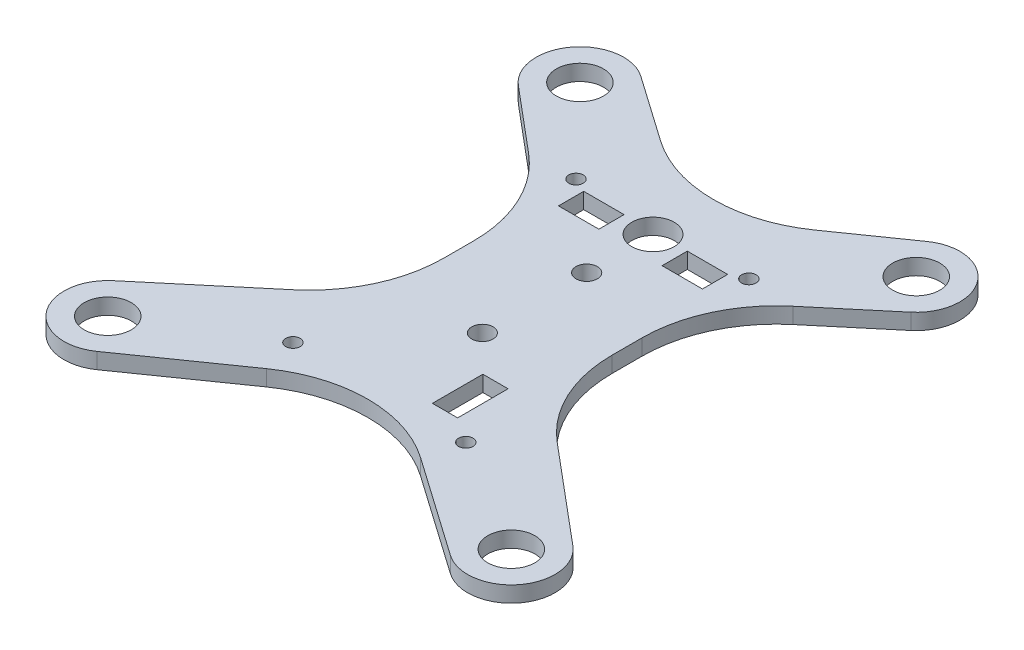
ISO-10303-21;
HEADER;
FILE_DESCRIPTION(('STEP AP214'),'2;1');
FILE_NAME('part.step','',(''),(''),'','','');
FILE_SCHEMA(('AUTOMOTIVE_DESIGN { 1 0 10303 214 1 1 1 1 }'));
ENDSEC;
DATA;
#1=APPLICATION_CONTEXT('core data for automotive mechanical design processes');
#2=APPLICATION_PROTOCOL_DEFINITION('international standard','automotive_design',2000,#1);
#3=PRODUCT_CONTEXT('',#1,'mechanical');
#4=PRODUCT('Part','Part','',(#3));
#5=PRODUCT_RELATED_PRODUCT_CATEGORY('part','',(#4));
#6=PRODUCT_DEFINITION_FORMATION('','',#4);
#7=PRODUCT_DEFINITION_CONTEXT('part definition',#1,'design');
#8=PRODUCT_DEFINITION('design','',#6,#7);
#9=PRODUCT_DEFINITION_SHAPE('','',#8);
#10=(LENGTH_UNIT() NAMED_UNIT(*) SI_UNIT(.MILLI.,.METRE.));
#11=(NAMED_UNIT(*) PLANE_ANGLE_UNIT() SI_UNIT($,.RADIAN.));
#12=(NAMED_UNIT(*) SI_UNIT($,.STERADIAN.) SOLID_ANGLE_UNIT());
#13=UNCERTAINTY_MEASURE_WITH_UNIT(LENGTH_MEASURE(1.E-05),#10,'distance_accuracy_value','');
#14=(GEOMETRIC_REPRESENTATION_CONTEXT(3) GLOBAL_UNCERTAINTY_ASSIGNED_CONTEXT((#13)) GLOBAL_UNIT_ASSIGNED_CONTEXT((#10,
#11,#12)) REPRESENTATION_CONTEXT('',''));
#15=CARTESIAN_POINT('',(0.,0.,0.));
#16=DIRECTION('',(0.,0.,1.));
#17=DIRECTION('',(1.,0.,0.));
#18=AXIS2_PLACEMENT_3D('',#15,#16,#17);
#19=CARTESIAN_POINT('',(0.,-2.3622,0.));
#20=DIRECTION('',(0.,1.,0.));
#21=DIRECTION('',(0.,0.,1.));
#22=AXIS2_PLACEMENT_3D('',#19,#20,#21);
#23=PLANE('',#22);
#24=DIRECTION('',(0.,0.,1.));
#25=VECTOR('',#24,1.);
#26=CARTESIAN_POINT('',(10.7,-2.3622,0.));
#27=LINE('',#26,#25);
#28=CARTESIAN_POINT('',(10.7,-2.3622,-21.2630989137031));
#29=VERTEX_POINT('',#28);
#30=CARTESIAN_POINT('',(10.7,-2.3622,-17.5130989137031));
#31=VERTEX_POINT('',#30);
#32=EDGE_CURVE('E305',#29,#31,#27,.T.);
#33=ORIENTED_EDGE('',*,*,#32,.F.);
#34=DIRECTION('',(1.,0.,0.));
#35=VECTOR('',#34,1.);
#36=CARTESIAN_POINT('',(0.,-2.3622,-21.2630989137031));
#37=LINE('',#36,#35);
#38=CARTESIAN_POINT('',(4.7,-2.3622,-21.2630989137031));
#39=VERTEX_POINT('',#38);
#40=EDGE_CURVE('E307',#39,#29,#37,.T.);
#41=ORIENTED_EDGE('',*,*,#40,.F.);
#42=DIRECTION('',(0.,0.,1.));
#43=VECTOR('',#42,1.);
#44=CARTESIAN_POINT('',(4.7,-2.3622,0.));
#45=LINE('',#44,#43);
#46=CARTESIAN_POINT('',(4.7,-2.3622,-17.5130989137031));
#47=VERTEX_POINT('',#46);
#48=EDGE_CURVE('E310',#39,#47,#45,.T.);
#49=ORIENTED_EDGE('',*,*,#48,.T.);
#50=DIRECTION('',(1.,0.,0.));
#51=VECTOR('',#50,1.);
#52=CARTESIAN_POINT('',(0.,-2.3622,-17.5130989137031));
#53=LINE('',#52,#51);
#54=EDGE_CURVE('E313',#47,#31,#53,.T.);
#55=ORIENTED_EDGE('',*,*,#54,.T.);
#56=EDGE_LOOP('',(#33,#41,#49,#55));
#57=FACE_BOUND('',#56,.T.);
#58=CARTESIAN_POINT('',(0.,-2.3622,-20.8630989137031));
#59=DIRECTION('',(0.,1.,0.));
#60=DIRECTION('',(0.,0.,1.));
#61=AXIS2_PLACEMENT_3D('',#58,#59,#60);
#62=CIRCLE('',#61,3.15);
#63=CARTESIAN_POINT('',(0.,-2.3622,-17.7130989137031));
#64=VERTEX_POINT('',#63);
#65=EDGE_CURVE('E336',#64,#64,#62,.T.);
#66=ORIENTED_EDGE('',*,*,#65,.T.);
#67=EDGE_LOOP('',(#66));
#68=FACE_BOUND('',#67,.T.);
#69=CARTESIAN_POINT('',(0.,-2.3622,-11.));
#70=DIRECTION('',(0.,1.,0.));
#71=DIRECTION('',(0.,0.,1.));
#72=AXIS2_PLACEMENT_3D('',#69,#70,#71);
#73=CIRCLE('',#72,1.5875);
#74=CARTESIAN_POINT('',(0.,-2.3622,-9.4125));
#75=VERTEX_POINT('',#74);
#76=EDGE_CURVE('E439',#75,#75,#73,.F.);
#77=ORIENTED_EDGE('',*,*,#76,.F.);
#78=EDGE_LOOP('',(#77));
#79=FACE_BOUND('',#78,.T.);
#80=CARTESIAN_POINT('',(0.,-2.3622,4.5));
#81=DIRECTION('',(0.,1.,0.));
#82=DIRECTION('',(0.,0.,1.));
#83=AXIS2_PLACEMENT_3D('',#80,#81,#82);
#84=CIRCLE('',#83,1.57926180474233);
#85=CARTESIAN_POINT('',(0.,-2.3622,6.07926180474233));
#86=VERTEX_POINT('',#85);
#87=EDGE_CURVE('E436',#86,#86,#84,.T.);
#88=ORIENTED_EDGE('',*,*,#87,.T.);
#89=EDGE_LOOP('',(#88));
#90=FACE_BOUND('',#89,.T.);
#91=CARTESIAN_POINT('',(-25.,-2.3622,-35.));
#92=DIRECTION('',(0.,1.,0.));
#93=DIRECTION('',(0.,0.,1.));
#94=AXIS2_PLACEMENT_3D('',#91,#92,#93);
#95=CIRCLE('',#94,6.50000000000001);
#96=CARTESIAN_POINT('',(-29.1781194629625,-2.3622,-30.0207111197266));
#97=VERTEX_POINT('',#96);
#98=CARTESIAN_POINT('',(-21.2717531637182,-2.3622,-40.3244882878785));
#99=VERTEX_POINT('',#98);
#100=EDGE_CURVE('E397',#97,#99,#95,.F.);
#101=ORIENTED_EDGE('',*,*,#100,.T.);
#102=DIRECTION('',(0.819152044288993,0.,0.573576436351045));
#103=VECTOR('',#102,1.);
#104=CARTESIAN_POINT('',(11.9481194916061,-2.3622,-17.0636830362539));
#105=LINE('',#104,#103);
#106=CARTESIAN_POINT('',(-11.4715287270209,-2.3622,-33.462297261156));
#107=VERTEX_POINT('',#106);
#108=EDGE_CURVE('E433',#99,#107,#105,.T.);
#109=ORIENTED_EDGE('',*,*,#108,.T.);
#110=CARTESIAN_POINT('',(0.,-2.3622,-49.8453381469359));
#111=DIRECTION('',(0.,1.,0.));
#112=DIRECTION('',(0.,0.,1.));
#113=AXIS2_PLACEMENT_3D('',#110,#111,#112);
#114=CIRCLE('',#113,20.);
#115=CARTESIAN_POINT('',(11.4715287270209,-2.3622,-33.462297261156));
#116=VERTEX_POINT('',#115);
#117=EDGE_CURVE('E545',#107,#116,#114,.T.);
#118=ORIENTED_EDGE('',*,*,#117,.T.);
#119=DIRECTION('',(-0.819152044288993,0.,0.573576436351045));
#120=VECTOR('',#119,1.);
#121=CARTESIAN_POINT('',(-11.9481194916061,-2.3622,-17.0636830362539));
#122=LINE('',#121,#120);
#123=CARTESIAN_POINT('',(21.2717531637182,-2.3622,-40.3244882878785));
#124=VERTEX_POINT('',#123);
#125=EDGE_CURVE('E430',#124,#116,#122,.T.);
#126=ORIENTED_EDGE('',*,*,#125,.F.);
#127=CARTESIAN_POINT('',(25.,-2.3622,-35.));
#128=DIRECTION('',(0.,1.,0.));
#129=DIRECTION('',(0.,0.,1.));
#130=AXIS2_PLACEMENT_3D('',#127,#128,#129);
#131=CIRCLE('',#130,6.50000000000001);
#132=CARTESIAN_POINT('',(29.1781194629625,-2.3622,-30.0207111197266));
#133=VERTEX_POINT('',#132);
#134=EDGE_CURVE('E427',#133,#124,#131,.T.);
#135=ORIENTED_EDGE('',*,*,#134,.F.);
#136=DIRECTION('',(0.766044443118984,0.,-0.642787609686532));
#137=VECTOR('',#136,1.);
#138=CARTESIAN_POINT('',(-2.72661843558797,-2.3622,-3.24945731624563));
#139=LINE('',#138,#137);
#140=CARTESIAN_POINT('',(19.6442478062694,-2.3622,-22.020842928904));
#141=VERTEX_POINT('',#140);
#142=EDGE_CURVE('E425',#141,#133,#139,.T.);
#143=ORIENTED_EDGE('',*,*,#142,.F.);
#144=CARTESIAN_POINT('',(32.5,-2.3622,-6.69995406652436));
#145=DIRECTION('',(0.,1.,0.));
#146=DIRECTION('',(0.,0.,1.));
#147=AXIS2_PLACEMENT_3D('',#144,#145,#146);
#148=CIRCLE('',#147,20.);
#149=CARTESIAN_POINT('',(12.5,-2.3622,-6.69995406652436));
#150=VERTEX_POINT('',#149);
#151=EDGE_CURVE('E549',#141,#150,#148,.T.);
#152=ORIENTED_EDGE('',*,*,#151,.T.);
#153=DIRECTION('',(0.,0.,1.));
#154=VECTOR('',#153,1.);
#155=CARTESIAN_POINT('',(12.5,-2.3622,0.));
#156=LINE('',#155,#154);
#157=CARTESIAN_POINT('',(12.5,-2.3622,-2.29554408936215));
#158=VERTEX_POINT('',#157);
#159=EDGE_CURVE('E422',#150,#158,#156,.T.);
#160=ORIENTED_EDGE('',*,*,#159,.T.);
#161=CARTESIAN_POINT('',(32.5,-2.3622,-2.29554408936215));
#162=DIRECTION('',(0.,1.,0.));
#163=DIRECTION('',(0.,0.,1.));
#164=AXIS2_PLACEMENT_3D('',#161,#162,#163);
#165=CIRCLE('',#164,20.);
#166=CARTESIAN_POINT('',(19.6442478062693,-2.3622,13.0253447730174));
#167=VERTEX_POINT('',#166);
#168=EDGE_CURVE('E553',#158,#167,#165,.T.);
#169=ORIENTED_EDGE('',*,*,#168,.T.);
#170=DIRECTION('',(0.766044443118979,0.,0.642787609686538));
#171=VECTOR('',#170,1.);
#172=CARTESIAN_POINT('',(1.70279972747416,-2.3622,-2.02931769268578));
#173=LINE('',#172,#171);
#174=CARTESIAN_POINT('',(34.1781194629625,-2.3622,25.2207111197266));
#175=VERTEX_POINT('',#174);
#176=EDGE_CURVE('E420',#167,#175,#173,.T.);
#177=ORIENTED_EDGE('',*,*,#176,.T.);
#178=CARTESIAN_POINT('',(30.,-2.3622,30.2));
#179=DIRECTION('',(0.,1.,0.));
#180=DIRECTION('',(0.,0.,1.));
#181=AXIS2_PLACEMENT_3D('',#178,#179,#180);
#182=CIRCLE('',#181,6.5);
#183=CARTESIAN_POINT('',(26.2717531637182,-2.3622,35.5244882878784));
#184=VERTEX_POINT('',#183);
#185=EDGE_CURVE('E417',#184,#175,#182,.T.);
#186=ORIENTED_EDGE('',*,*,#185,.F.);
#187=DIRECTION('',(-0.819152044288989,0.,-0.57357643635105));
#188=VECTOR('',#187,1.);
#189=CARTESIAN_POINT('',(-8.04790756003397,-2.3622,11.4936031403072));
#190=LINE('',#189,#188);
#191=CARTESIAN_POINT('',(11.471528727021,-2.3622,25.1612595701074));
#192=VERTEX_POINT('',#191);
#193=EDGE_CURVE('E414',#184,#192,#190,.T.);
#194=ORIENTED_EDGE('',*,*,#193,.T.);
#195=CARTESIAN_POINT('',(0.,-2.3622,41.5443004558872));
#196=DIRECTION('',(0.,1.,0.));
#197=DIRECTION('',(0.,0.,1.));
#198=AXIS2_PLACEMENT_3D('',#195,#196,#197);
#199=CIRCLE('',#198,20.);
#200=CARTESIAN_POINT('',(-11.471528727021,-2.3622,25.1612595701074));
#201=VERTEX_POINT('',#200);
#202=EDGE_CURVE('E11',#192,#201,#199,.T.);
#203=ORIENTED_EDGE('',*,*,#202,.T.);
#204=DIRECTION('',(0.819152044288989,0.,-0.57357643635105));
#205=VECTOR('',#204,1.);
#206=CARTESIAN_POINT('',(8.04790756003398,-2.3622,11.4936031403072));
#207=LINE('',#206,#205);
#208=CARTESIAN_POINT('',(-26.2717531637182,-2.3622,35.5244882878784));
#209=VERTEX_POINT('',#208);
#210=EDGE_CURVE('E411',#209,#201,#207,.T.);
#211=ORIENTED_EDGE('',*,*,#210,.F.);
#212=CARTESIAN_POINT('',(-30.,-2.3622,30.2));
#213=DIRECTION('',(0.,1.,0.));
#214=DIRECTION('',(0.,0.,1.));
#215=AXIS2_PLACEMENT_3D('',#212,#213,#214);
#216=CIRCLE('',#215,6.5);
#217=CARTESIAN_POINT('',(-34.1781194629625,-2.3622,25.2207111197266));
#218=VERTEX_POINT('',#217);
#219=EDGE_CURVE('E408',#209,#218,#216,.F.);
#220=ORIENTED_EDGE('',*,*,#219,.T.);
#221=DIRECTION('',(-0.766044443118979,0.,0.642787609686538));
#222=VECTOR('',#221,1.);
#223=CARTESIAN_POINT('',(-1.70279972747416,-2.3622,-2.02931769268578));
#224=LINE('',#223,#222);
#225=CARTESIAN_POINT('',(-19.6442478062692,-2.3622,13.0253447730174));
#226=VERTEX_POINT('',#225);
#227=EDGE_CURVE('E406',#226,#218,#224,.T.);
#228=ORIENTED_EDGE('',*,*,#227,.F.);
#229=CARTESIAN_POINT('',(-32.5,-2.3622,-2.29554408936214));
#230=DIRECTION('',(0.,1.,0.));
#231=DIRECTION('',(0.,0.,1.));
#232=AXIS2_PLACEMENT_3D('',#229,#230,#231);
#233=CIRCLE('',#232,20.);
#234=CARTESIAN_POINT('',(-12.5,-2.3622,-2.29554408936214));
#235=VERTEX_POINT('',#234);
#236=EDGE_CURVE('E537',#226,#235,#233,.T.);
#237=ORIENTED_EDGE('',*,*,#236,.T.);
#238=DIRECTION('',(0.,0.,1.));
#239=VECTOR('',#238,1.);
#240=CARTESIAN_POINT('',(-12.5,-2.3622,0.));
#241=LINE('',#240,#239);
#242=CARTESIAN_POINT('',(-12.5,-2.3622,-6.69995406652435));
#243=VERTEX_POINT('',#242);
#244=EDGE_CURVE('E403',#243,#235,#241,.T.);
#245=ORIENTED_EDGE('',*,*,#244,.F.);
#246=CARTESIAN_POINT('',(-32.5,-2.3622,-6.69995406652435));
#247=DIRECTION('',(0.,1.,0.));
#248=DIRECTION('',(0.,0.,1.));
#249=AXIS2_PLACEMENT_3D('',#246,#247,#248);
#250=CIRCLE('',#249,20.);
#251=CARTESIAN_POINT('',(-19.6442478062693,-2.3622,-22.020842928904));
#252=VERTEX_POINT('',#251);
#253=EDGE_CURVE('E541',#243,#252,#250,.T.);
#254=ORIENTED_EDGE('',*,*,#253,.T.);
#255=DIRECTION('',(-0.766044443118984,0.,-0.642787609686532));
#256=VECTOR('',#255,1.);
#257=CARTESIAN_POINT('',(2.72661843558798,-2.3622,-3.24945731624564));
#258=LINE('',#257,#256);
#259=EDGE_CURVE('E400',#252,#97,#258,.T.);
#260=ORIENTED_EDGE('',*,*,#259,.T.);
#261=EDGE_LOOP('',(#101,#109,#118,#126,#135,#143,#152,#160,#169,#177,#186,#194,#203,#211,#220,
#228,#237,#245,#254,#260));
#262=FACE_BOUND('',#261,.T.);
#263=CARTESIAN_POINT('',(-30.,-2.3622,30.2));
#264=DIRECTION('',(0.,1.,0.));
#265=DIRECTION('',(0.,0.,1.));
#266=AXIS2_PLACEMENT_3D('',#263,#264,#265);
#267=CIRCLE('',#266,3.5);
#268=CARTESIAN_POINT('',(-30.,-2.3622,33.7));
#269=VERTEX_POINT('',#268);
#270=EDGE_CURVE('E393',#269,#269,#267,.T.);
#271=ORIENTED_EDGE('',*,*,#270,.T.);
#272=EDGE_LOOP('',(#271));
#273=FACE_BOUND('',#272,.T.);
#274=CARTESIAN_POINT('',(30.,-2.3622,30.2));
#275=DIRECTION('',(0.,1.,0.));
#276=DIRECTION('',(0.,0.,1.));
#277=AXIS2_PLACEMENT_3D('',#274,#275,#276);
#278=CIRCLE('',#277,3.5);
#279=CARTESIAN_POINT('',(30.,-2.3622,33.7));
#280=VERTEX_POINT('',#279);
#281=EDGE_CURVE('E387',#280,#280,#278,.T.);
#282=ORIENTED_EDGE('',*,*,#281,.T.);
#283=EDGE_LOOP('',(#282));
#284=FACE_BOUND('',#283,.T.);
#285=CARTESIAN_POINT('',(25.,-2.3622,-35.));
#286=DIRECTION('',(0.,1.,0.));
#287=DIRECTION('',(0.,0.,1.));
#288=AXIS2_PLACEMENT_3D('',#285,#286,#287);
#289=CIRCLE('',#288,3.5);
#290=CARTESIAN_POINT('',(25.,-2.3622,-31.5));
#291=VERTEX_POINT('',#290);
#292=EDGE_CURVE('E381',#291,#291,#289,.T.);
#293=ORIENTED_EDGE('',*,*,#292,.T.);
#294=EDGE_LOOP('',(#293));
#295=FACE_BOUND('',#294,.T.);
#296=CARTESIAN_POINT('',(-25.,-2.3622,-35.));
#297=DIRECTION('',(0.,1.,0.));
#298=DIRECTION('',(0.,0.,1.));
#299=AXIS2_PLACEMENT_3D('',#296,#297,#298);
#300=CIRCLE('',#299,3.5);
#301=CARTESIAN_POINT('',(-25.,-2.3622,-31.5));
#302=VERTEX_POINT('',#301);
#303=EDGE_CURVE('E375',#302,#302,#300,.T.);
#304=ORIENTED_EDGE('',*,*,#303,.T.);
#305=EDGE_LOOP('',(#304));
#306=FACE_BOUND('',#305,.T.);
#307=DIRECTION('',(0.,0.,1.));
#308=VECTOR('',#307,1.);
#309=CARTESIAN_POINT('',(-4.69999999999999,-2.3622,0.));
#310=LINE('',#309,#308);
#311=CARTESIAN_POINT('',(-4.7,-2.3622,-21.2630989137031));
#312=VERTEX_POINT('',#311);
#313=CARTESIAN_POINT('',(-4.7,-2.3622,-17.5130989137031));
#314=VERTEX_POINT('',#313);
#315=EDGE_CURVE('E342',#312,#314,#310,.T.);
#316=ORIENTED_EDGE('',*,*,#315,.F.);
#317=DIRECTION('',(1.,0.,0.));
#318=VECTOR('',#317,1.);
#319=CARTESIAN_POINT('',(0.,-2.3622,-21.2630989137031));
#320=LINE('',#319,#318);
#321=CARTESIAN_POINT('',(-10.7,-2.3622,-21.2630989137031));
#322=VERTEX_POINT('',#321);
#323=EDGE_CURVE('E344',#322,#312,#320,.T.);
#324=ORIENTED_EDGE('',*,*,#323,.F.);
#325=DIRECTION('',(0.,0.,1.));
#326=VECTOR('',#325,1.);
#327=CARTESIAN_POINT('',(-10.7,-2.3622,0.));
#328=LINE('',#327,#326);
#329=CARTESIAN_POINT('',(-10.7,-2.3622,-17.5130989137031));
#330=VERTEX_POINT('',#329);
#331=EDGE_CURVE('E347',#322,#330,#328,.T.);
#332=ORIENTED_EDGE('',*,*,#331,.T.);
#333=DIRECTION('',(1.,0.,0.));
#334=VECTOR('',#333,1.);
#335=CARTESIAN_POINT('',(0.,-2.3622,-17.5130989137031));
#336=LINE('',#335,#334);
#337=EDGE_CURVE('E350',#330,#314,#336,.T.);
#338=ORIENTED_EDGE('',*,*,#337,.T.);
#339=EDGE_LOOP('',(#316,#324,#332,#338));
#340=FACE_BOUND('',#339,.T.);
#341=CARTESIAN_POINT('',(12.85,-2.3622,-22.2630989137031));
#342=DIRECTION('',(0.,1.,0.));
#343=DIRECTION('',(0.,0.,1.));
#344=AXIS2_PLACEMENT_3D('',#341,#342,#343);
#345=CIRCLE('',#344,1.075);
#346=CARTESIAN_POINT('',(12.85,-2.3622,-21.1880989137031));
#347=VERTEX_POINT('',#346);
#348=EDGE_CURVE('E299',#347,#347,#345,.T.);
#349=ORIENTED_EDGE('',*,*,#348,.T.);
#350=EDGE_LOOP('',(#349));
#351=FACE_BOUND('',#350,.T.);
#352=CARTESIAN_POINT('',(-12.85,-2.3622,-22.2630989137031));
#353=DIRECTION('',(0.,1.,0.));
#354=DIRECTION('',(0.,0.,1.));
#355=AXIS2_PLACEMENT_3D('',#352,#353,#354);
#356=CIRCLE('',#355,1.075);
#357=CARTESIAN_POINT('',(-12.85,-2.3622,-21.1880989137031));
#358=VERTEX_POINT('',#357);
#359=EDGE_CURVE('E293',#358,#358,#356,.T.);
#360=ORIENTED_EDGE('',*,*,#359,.T.);
#361=EDGE_LOOP('',(#360));
#362=FACE_BOUND('',#361,.T.);
#363=CARTESIAN_POINT('',(-12.85,-2.3622,19.8169010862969));
#364=DIRECTION('',(0.,1.,0.));
#365=DIRECTION('',(0.,0.,1.));
#366=AXIS2_PLACEMENT_3D('',#363,#364,#365);
#367=CIRCLE('',#366,1.075);
#368=CARTESIAN_POINT('',(-12.85,-2.3622,20.8919010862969));
#369=VERTEX_POINT('',#368);
#370=EDGE_CURVE('E287',#369,#369,#367,.T.);
#371=ORIENTED_EDGE('',*,*,#370,.T.);
#372=EDGE_LOOP('',(#371));
#373=FACE_BOUND('',#372,.T.);
#374=CARTESIAN_POINT('',(12.85,-2.3622,19.8169010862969));
#375=DIRECTION('',(0.,1.,0.));
#376=DIRECTION('',(0.,0.,1.));
#377=AXIS2_PLACEMENT_3D('',#374,#375,#376);
#378=CIRCLE('',#377,1.075);
#379=CARTESIAN_POINT('',(12.85,-2.3622,20.8919010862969));
#380=VERTEX_POINT('',#379);
#381=EDGE_CURVE('E281',#380,#380,#378,.T.);
#382=ORIENTED_EDGE('',*,*,#381,.T.);
#383=EDGE_LOOP('',(#382));
#384=FACE_BOUND('',#383,.T.);
#385=DIRECTION('',(0.,0.,1.));
#386=VECTOR('',#385,1.);
#387=CARTESIAN_POINT('',(9.1,-2.3622,0.));
#388=LINE('',#387,#386);
#389=CARTESIAN_POINT('',(9.1,-2.3622,9.78264011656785));
#390=VERTEX_POINT('',#389);
#391=CARTESIAN_POINT('',(9.1,-2.3622,17.2826401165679));
#392=VERTEX_POINT('',#391);
#393=EDGE_CURVE('E254',#390,#392,#388,.T.);
#394=ORIENTED_EDGE('',*,*,#393,.F.);
#395=DIRECTION('',(1.,0.,0.));
#396=VECTOR('',#395,1.);
#397=CARTESIAN_POINT('',(0.,-2.3622,9.78264011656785));
#398=LINE('',#397,#396);
#399=CARTESIAN_POINT('',(5.35,-2.3622,9.78264011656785));
#400=VERTEX_POINT('',#399);
#401=EDGE_CURVE('E246',#400,#390,#398,.T.);
#402=ORIENTED_EDGE('',*,*,#401,.F.);
#403=DIRECTION('',(0.,0.,1.));
#404=VECTOR('',#403,1.);
#405=CARTESIAN_POINT('',(5.35,-2.3622,0.));
#406=LINE('',#405,#404);
#407=CARTESIAN_POINT('',(5.35,-2.3622,17.2826401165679));
#408=VERTEX_POINT('',#407);
#409=EDGE_CURVE('E53',#400,#408,#406,.T.);
#410=ORIENTED_EDGE('',*,*,#409,.T.);
#411=DIRECTION('',(1.,0.,0.));
#412=VECTOR('',#411,1.);
#413=CARTESIAN_POINT('',(0.,-2.3622,17.2826401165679));
#414=LINE('',#413,#412);
#415=EDGE_CURVE('E258',#408,#392,#414,.T.);
#416=ORIENTED_EDGE('',*,*,#415,.T.);
#417=EDGE_LOOP('',(#394,#402,#410,#416));
#418=FACE_BOUND('',#417,.T.);
#419=ADVANCED_FACE('F38',(#57,#68,#79,#90,#262,#273,#284,#295,#306,#340,#351,#362,#373,#384,
#418),#23,.F.);
#420=CARTESIAN_POINT('',(0.,0.,0.));
#421=DIRECTION('',(0.,1.,0.));
#422=DIRECTION('',(0.,0.,1.));
#423=AXIS2_PLACEMENT_3D('',#420,#421,#422);
#424=PLANE('',#423);
#425=CARTESIAN_POINT('',(12.85,0.,19.8169010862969));
#426=DIRECTION('',(0.,1.,0.));
#427=DIRECTION('',(0.,0.,1.));
#428=AXIS2_PLACEMENT_3D('',#425,#426,#427);
#429=CIRCLE('',#428,1.075);
#430=CARTESIAN_POINT('',(12.85,0.,20.8919010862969));
#431=VERTEX_POINT('',#430);
#432=EDGE_CURVE('E277',#431,#431,#429,.T.);
#433=ORIENTED_EDGE('',*,*,#432,.F.);
#434=EDGE_LOOP('',(#433));
#435=FACE_BOUND('',#434,.T.);
#436=CARTESIAN_POINT('',(-12.85,0.,19.8169010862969));
#437=DIRECTION('',(0.,1.,0.));
#438=DIRECTION('',(0.,0.,1.));
#439=AXIS2_PLACEMENT_3D('',#436,#437,#438);
#440=CIRCLE('',#439,1.075);
#441=CARTESIAN_POINT('',(-12.85,0.,20.8919010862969));
#442=VERTEX_POINT('',#441);
#443=EDGE_CURVE('E284',#442,#442,#440,.T.);
#444=ORIENTED_EDGE('',*,*,#443,.F.);
#445=EDGE_LOOP('',(#444));
#446=FACE_BOUND('',#445,.T.);
#447=CARTESIAN_POINT('',(-12.85,0.,-22.2630989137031));
#448=DIRECTION('',(0.,1.,0.));
#449=DIRECTION('',(0.,0.,1.));
#450=AXIS2_PLACEMENT_3D('',#447,#448,#449);
#451=CIRCLE('',#450,1.075);
#452=CARTESIAN_POINT('',(-12.85,0.,-21.1880989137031));
#453=VERTEX_POINT('',#452);
#454=EDGE_CURVE('E290',#453,#453,#451,.T.);
#455=ORIENTED_EDGE('',*,*,#454,.F.);
#456=EDGE_LOOP('',(#455));
#457=FACE_BOUND('',#456,.T.);
#458=CARTESIAN_POINT('',(12.85,0.,-22.2630989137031));
#459=DIRECTION('',(0.,1.,0.));
#460=DIRECTION('',(0.,0.,1.));
#461=AXIS2_PLACEMENT_3D('',#458,#459,#460);
#462=CIRCLE('',#461,1.075);
#463=CARTESIAN_POINT('',(12.85,0.,-21.1880989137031));
#464=VERTEX_POINT('',#463);
#465=EDGE_CURVE('E296',#464,#464,#462,.T.);
#466=ORIENTED_EDGE('',*,*,#465,.F.);
#467=EDGE_LOOP('',(#466));
#468=FACE_BOUND('',#467,.T.);
#469=CARTESIAN_POINT('',(0.,0.,-20.8630989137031));
#470=DIRECTION('',(0.,1.,0.));
#471=DIRECTION('',(0.,0.,1.));
#472=AXIS2_PLACEMENT_3D('',#469,#470,#471);
#473=CIRCLE('',#472,3.15);
#474=CARTESIAN_POINT('',(0.,0.,-17.7130989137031));
#475=VERTEX_POINT('',#474);
#476=EDGE_CURVE('E329',#475,#475,#473,.T.);
#477=ORIENTED_EDGE('',*,*,#476,.F.);
#478=EDGE_LOOP('',(#477));
#479=FACE_BOUND('',#478,.T.);
#480=CARTESIAN_POINT('',(-25.,0.,-35.));
#481=DIRECTION('',(0.,1.,0.));
#482=DIRECTION('',(0.,0.,1.));
#483=AXIS2_PLACEMENT_3D('',#480,#481,#482);
#484=CIRCLE('',#483,3.5);
#485=CARTESIAN_POINT('',(-25.,0.,-31.5));
#486=VERTEX_POINT('',#485);
#487=EDGE_CURVE('E366',#486,#486,#484,.T.);
#488=ORIENTED_EDGE('',*,*,#487,.F.);
#489=EDGE_LOOP('',(#488));
#490=FACE_BOUND('',#489,.T.);
#491=CARTESIAN_POINT('',(25.,0.,-35.));
#492=DIRECTION('',(0.,1.,0.));
#493=DIRECTION('',(0.,0.,1.));
#494=AXIS2_PLACEMENT_3D('',#491,#492,#493);
#495=CIRCLE('',#494,3.5);
#496=CARTESIAN_POINT('',(25.,0.,-31.5));
#497=VERTEX_POINT('',#496);
#498=EDGE_CURVE('E378',#497,#497,#495,.T.);
#499=ORIENTED_EDGE('',*,*,#498,.F.);
#500=EDGE_LOOP('',(#499));
#501=FACE_BOUND('',#500,.T.);
#502=CARTESIAN_POINT('',(30.,0.,30.2));
#503=DIRECTION('',(0.,1.,0.));
#504=DIRECTION('',(0.,0.,1.));
#505=AXIS2_PLACEMENT_3D('',#502,#503,#504);
#506=CIRCLE('',#505,3.5);
#507=CARTESIAN_POINT('',(30.,0.,33.7));
#508=VERTEX_POINT('',#507);
#509=EDGE_CURVE('E384',#508,#508,#506,.T.);
#510=ORIENTED_EDGE('',*,*,#509,.F.);
#511=EDGE_LOOP('',(#510));
#512=FACE_BOUND('',#511,.T.);
#513=CARTESIAN_POINT('',(-30.,0.,30.2));
#514=DIRECTION('',(0.,1.,0.));
#515=DIRECTION('',(0.,0.,1.));
#516=AXIS2_PLACEMENT_3D('',#513,#514,#515);
#517=CIRCLE('',#516,3.5);
#518=CARTESIAN_POINT('',(-30.,0.,33.7));
#519=VERTEX_POINT('',#518);
#520=EDGE_CURVE('E390',#519,#519,#517,.T.);
#521=ORIENTED_EDGE('',*,*,#520,.F.);
#522=EDGE_LOOP('',(#521));
#523=FACE_BOUND('',#522,.T.);
#524=CARTESIAN_POINT('',(-25.,0.,-35.));
#525=DIRECTION('',(0.,1.,0.));
#526=DIRECTION('',(0.,0.,1.));
#527=AXIS2_PLACEMENT_3D('',#524,#525,#526);
#528=CIRCLE('',#527,6.50000000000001);
#529=CARTESIAN_POINT('',(-29.1781194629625,0.,-30.0207111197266));
#530=VERTEX_POINT('',#529);
#531=CARTESIAN_POINT('',(-21.2717531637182,0.,-40.3244882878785));
#532=VERTEX_POINT('',#531);
#533=EDGE_CURVE('E396',#530,#532,#528,.F.);
#534=ORIENTED_EDGE('',*,*,#533,.F.);
#535=DIRECTION('',(-0.766044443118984,0.,-0.642787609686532));
#536=VECTOR('',#535,1.);
#537=CARTESIAN_POINT('',(2.72661843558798,0.,-3.24945731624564));
#538=LINE('',#537,#536);
#539=CARTESIAN_POINT('',(-19.6442478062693,0.,-22.020842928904));
#540=VERTEX_POINT('',#539);
#541=EDGE_CURVE('E445',#540,#530,#538,.T.);
#542=ORIENTED_EDGE('',*,*,#541,.F.);
#543=CARTESIAN_POINT('',(-32.5,0.,-6.69995406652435));
#544=DIRECTION('',(0.,1.,0.));
#545=DIRECTION('',(0.,0.,1.));
#546=AXIS2_PLACEMENT_3D('',#543,#544,#545);
#547=CIRCLE('',#546,20.);
#548=CARTESIAN_POINT('',(-12.5,0.,-6.69995406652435));
#549=VERTEX_POINT('',#548);
#550=EDGE_CURVE('E539',#540,#549,#547,.F.);
#551=ORIENTED_EDGE('',*,*,#550,.T.);
#552=DIRECTION('',(0.,0.,1.));
#553=VECTOR('',#552,1.);
#554=CARTESIAN_POINT('',(-12.5,0.,0.));
#555=LINE('',#554,#553);
#556=CARTESIAN_POINT('',(-12.5,0.,-2.29554408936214));
#557=VERTEX_POINT('',#556);
#558=EDGE_CURVE('E447',#549,#557,#555,.T.);
#559=ORIENTED_EDGE('',*,*,#558,.T.);
#560=CARTESIAN_POINT('',(-32.5,0.,-2.29554408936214));
#561=DIRECTION('',(0.,1.,0.));
#562=DIRECTION('',(0.,0.,1.));
#563=AXIS2_PLACEMENT_3D('',#560,#561,#562);
#564=CIRCLE('',#563,20.);
#565=CARTESIAN_POINT('',(-19.6442478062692,0.,13.0253447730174));
#566=VERTEX_POINT('',#565);
#567=EDGE_CURVE('E535',#557,#566,#564,.F.);
#568=ORIENTED_EDGE('',*,*,#567,.T.);
#569=DIRECTION('',(-0.766044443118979,0.,0.642787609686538));
#570=VECTOR('',#569,1.);
#571=CARTESIAN_POINT('',(-1.70279972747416,0.,-2.02931769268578));
#572=LINE('',#571,#570);
#573=CARTESIAN_POINT('',(-34.1781194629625,0.,25.2207111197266));
#574=VERTEX_POINT('',#573);
#575=EDGE_CURVE('E450',#566,#574,#572,.T.);
#576=ORIENTED_EDGE('',*,*,#575,.T.);
#577=CARTESIAN_POINT('',(-30.,0.,30.2));
#578=DIRECTION('',(0.,1.,0.));
#579=DIRECTION('',(0.,0.,1.));
#580=AXIS2_PLACEMENT_3D('',#577,#578,#579);
#581=CIRCLE('',#580,6.5);
#582=CARTESIAN_POINT('',(-26.2717531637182,0.,35.5244882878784));
#583=VERTEX_POINT('',#582);
#584=EDGE_CURVE('E452',#583,#574,#581,.F.);
#585=ORIENTED_EDGE('',*,*,#584,.F.);
#586=DIRECTION('',(0.819152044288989,0.,-0.57357643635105));
#587=VECTOR('',#586,1.);
#588=CARTESIAN_POINT('',(8.04790756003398,0.,11.4936031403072));
#589=LINE('',#588,#587);
#590=CARTESIAN_POINT('',(-11.471528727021,0.,25.1612595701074));
#591=VERTEX_POINT('',#590);
#592=EDGE_CURVE('E455',#583,#591,#589,.T.);
#593=ORIENTED_EDGE('',*,*,#592,.T.);
#594=CARTESIAN_POINT('',(0.,0.,41.5443004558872));
#595=DIRECTION('',(0.,1.,0.));
#596=DIRECTION('',(0.,0.,1.));
#597=AXIS2_PLACEMENT_3D('',#594,#595,#596);
#598=CIRCLE('',#597,20.);
#599=CARTESIAN_POINT('',(11.471528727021,0.,25.1612595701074));
#600=VERTEX_POINT('',#599);
#601=EDGE_CURVE('E46',#591,#600,#598,.F.);
#602=ORIENTED_EDGE('',*,*,#601,.T.);
#603=DIRECTION('',(-0.819152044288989,0.,-0.57357643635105));
#604=VECTOR('',#603,1.);
#605=CARTESIAN_POINT('',(-8.04790756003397,0.,11.4936031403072));
#606=LINE('',#605,#604);
#607=CARTESIAN_POINT('',(26.2717531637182,0.,35.5244882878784));
#608=VERTEX_POINT('',#607);
#609=EDGE_CURVE('E458',#608,#600,#606,.T.);
#610=ORIENTED_EDGE('',*,*,#609,.F.);
#611=CARTESIAN_POINT('',(30.,0.,30.2));
#612=DIRECTION('',(0.,1.,0.));
#613=DIRECTION('',(0.,0.,1.));
#614=AXIS2_PLACEMENT_3D('',#611,#612,#613);
#615=CIRCLE('',#614,6.5);
#616=CARTESIAN_POINT('',(34.1781194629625,0.,25.2207111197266));
#617=VERTEX_POINT('',#616);
#618=EDGE_CURVE('E461',#608,#617,#615,.T.);
#619=ORIENTED_EDGE('',*,*,#618,.T.);
#620=DIRECTION('',(0.766044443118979,0.,0.642787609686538));
#621=VECTOR('',#620,1.);
#622=CARTESIAN_POINT('',(1.70279972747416,0.,-2.02931769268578));
#623=LINE('',#622,#621);
#624=CARTESIAN_POINT('',(19.6442478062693,0.,13.0253447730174));
#625=VERTEX_POINT('',#624);
#626=EDGE_CURVE('E464',#625,#617,#623,.T.);
#627=ORIENTED_EDGE('',*,*,#626,.F.);
#628=CARTESIAN_POINT('',(32.5,0.,-2.29554408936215));
#629=DIRECTION('',(0.,1.,0.));
#630=DIRECTION('',(0.,0.,1.));
#631=AXIS2_PLACEMENT_3D('',#628,#629,#630);
#632=CIRCLE('',#631,20.);
#633=CARTESIAN_POINT('',(12.5,0.,-2.29554408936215));
#634=VERTEX_POINT('',#633);
#635=EDGE_CURVE('E551',#625,#634,#632,.F.);
#636=ORIENTED_EDGE('',*,*,#635,.T.);
#637=DIRECTION('',(0.,0.,1.));
#638=VECTOR('',#637,1.);
#639=CARTESIAN_POINT('',(12.5,0.,0.));
#640=LINE('',#639,#638);
#641=CARTESIAN_POINT('',(12.5,0.,-6.69995406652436));
#642=VERTEX_POINT('',#641);
#643=EDGE_CURVE('E466',#642,#634,#640,.T.);
#644=ORIENTED_EDGE('',*,*,#643,.F.);
#645=CARTESIAN_POINT('',(32.5,0.,-6.69995406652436));
#646=DIRECTION('',(0.,1.,0.));
#647=DIRECTION('',(0.,0.,1.));
#648=AXIS2_PLACEMENT_3D('',#645,#646,#647);
#649=CIRCLE('',#648,20.);
#650=CARTESIAN_POINT('',(19.6442478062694,0.,-22.020842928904));
#651=VERTEX_POINT('',#650);
#652=EDGE_CURVE('E547',#642,#651,#649,.F.);
#653=ORIENTED_EDGE('',*,*,#652,.T.);
#654=DIRECTION('',(0.766044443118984,0.,-0.642787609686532));
#655=VECTOR('',#654,1.);
#656=CARTESIAN_POINT('',(-2.72661843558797,0.,-3.24945731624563));
#657=LINE('',#656,#655);
#658=CARTESIAN_POINT('',(29.1781194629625,0.,-30.0207111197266));
#659=VERTEX_POINT('',#658);
#660=EDGE_CURVE('E469',#651,#659,#657,.T.);
#661=ORIENTED_EDGE('',*,*,#660,.T.);
#662=CARTESIAN_POINT('',(25.,0.,-35.));
#663=DIRECTION('',(0.,1.,0.));
#664=DIRECTION('',(0.,0.,1.));
#665=AXIS2_PLACEMENT_3D('',#662,#663,#664);
#666=CIRCLE('',#665,6.50000000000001);
#667=CARTESIAN_POINT('',(21.2717531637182,0.,-40.3244882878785));
#668=VERTEX_POINT('',#667);
#669=EDGE_CURVE('E471',#659,#668,#666,.T.);
#670=ORIENTED_EDGE('',*,*,#669,.T.);
#671=DIRECTION('',(-0.819152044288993,0.,0.573576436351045));
#672=VECTOR('',#671,1.);
#673=CARTESIAN_POINT('',(-11.9481194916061,0.,-17.0636830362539));
#674=LINE('',#673,#672);
#675=CARTESIAN_POINT('',(11.4715287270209,0.,-33.462297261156));
#676=VERTEX_POINT('',#675);
#677=EDGE_CURVE('E474',#668,#676,#674,.T.);
#678=ORIENTED_EDGE('',*,*,#677,.T.);
#679=CARTESIAN_POINT('',(0.,0.,-49.8453381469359));
#680=DIRECTION('',(0.,1.,0.));
#681=DIRECTION('',(0.,0.,1.));
#682=AXIS2_PLACEMENT_3D('',#679,#680,#681);
#683=CIRCLE('',#682,20.);
#684=CARTESIAN_POINT('',(-11.4715287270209,0.,-33.462297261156));
#685=VERTEX_POINT('',#684);
#686=EDGE_CURVE('E543',#676,#685,#683,.F.);
#687=ORIENTED_EDGE('',*,*,#686,.T.);
#688=DIRECTION('',(0.819152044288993,0.,0.573576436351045));
#689=VECTOR('',#688,1.);
#690=CARTESIAN_POINT('',(11.9481194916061,0.,-17.0636830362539));
#691=LINE('',#690,#689);
#692=EDGE_CURVE('E477',#532,#685,#691,.T.);
#693=ORIENTED_EDGE('',*,*,#692,.F.);
#694=EDGE_LOOP('',(#534,#542,#551,#559,#568,#576,#585,#593,#602,#610,#619,#627,#636,#644,#653,
#661,#670,#678,#687,#693));
#695=FACE_BOUND('',#694,.T.);
#696=CARTESIAN_POINT('',(0.,0.,4.5));
#697=DIRECTION('',(0.,1.,0.));
#698=DIRECTION('',(0.,0.,1.));
#699=AXIS2_PLACEMENT_3D('',#696,#697,#698);
#700=CIRCLE('',#699,1.57926180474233);
#701=CARTESIAN_POINT('',(0.,0.,6.07926180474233));
#702=VERTEX_POINT('',#701);
#703=EDGE_CURVE('E480',#702,#702,#700,.T.);
#704=ORIENTED_EDGE('',*,*,#703,.F.);
#705=EDGE_LOOP('',(#704));
#706=FACE_BOUND('',#705,.T.);
#707=CARTESIAN_POINT('',(0.,0.,-11.));
#708=DIRECTION('',(0.,1.,0.));
#709=DIRECTION('',(0.,0.,1.));
#710=AXIS2_PLACEMENT_3D('',#707,#708,#709);
#711=CIRCLE('',#710,1.5875);
#712=CARTESIAN_POINT('',(0.,0.,-9.4125));
#713=VERTEX_POINT('',#712);
#714=EDGE_CURVE('E401',#713,#713,#711,.F.);
#715=ORIENTED_EDGE('',*,*,#714,.T.);
#716=EDGE_LOOP('',(#715));
#717=FACE_BOUND('',#716,.T.);
#718=DIRECTION('',(1.,0.,0.));
#719=VECTOR('',#718,1.);
#720=CARTESIAN_POINT('',(0.,0.,-21.2630989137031));
#721=LINE('',#720,#719);
#722=CARTESIAN_POINT('',(-10.7,0.,-21.2630989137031));
#723=VERTEX_POINT('',#722);
#724=CARTESIAN_POINT('',(-4.7,0.,-21.2630989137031));
#725=VERTEX_POINT('',#724);
#726=EDGE_CURVE('E356',#723,#725,#721,.T.);
#727=ORIENTED_EDGE('',*,*,#726,.T.);
#728=DIRECTION('',(0.,0.,1.));
#729=VECTOR('',#728,1.);
#730=CARTESIAN_POINT('',(-4.69999999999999,0.,0.));
#731=LINE('',#730,#729);
#732=CARTESIAN_POINT('',(-4.7,0.,-17.5130989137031));
#733=VERTEX_POINT('',#732);
#734=EDGE_CURVE('E339',#725,#733,#731,.T.);
#735=ORIENTED_EDGE('',*,*,#734,.T.);
#736=DIRECTION('',(1.,0.,0.));
#737=VECTOR('',#736,1.);
#738=CARTESIAN_POINT('',(0.,0.,-17.5130989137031));
#739=LINE('',#738,#737);
#740=CARTESIAN_POINT('',(-10.7,0.,-17.5130989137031));
#741=VERTEX_POINT('',#740);
#742=EDGE_CURVE('E345',#741,#733,#739,.T.);
#743=ORIENTED_EDGE('',*,*,#742,.F.);
#744=DIRECTION('',(0.,0.,1.));
#745=VECTOR('',#744,1.);
#746=CARTESIAN_POINT('',(-10.7,0.,0.));
#747=LINE('',#746,#745);
#748=EDGE_CURVE('E359',#723,#741,#747,.T.);
#749=ORIENTED_EDGE('',*,*,#748,.F.);
#750=EDGE_LOOP('',(#727,#735,#743,#749));
#751=FACE_BOUND('',#750,.T.);
#752=DIRECTION('',(1.,0.,0.));
#753=VECTOR('',#752,1.);
#754=CARTESIAN_POINT('',(0.,0.,-21.2630989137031));
#755=LINE('',#754,#753);
#756=CARTESIAN_POINT('',(4.7,0.,-21.2630989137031));
#757=VERTEX_POINT('',#756);
#758=CARTESIAN_POINT('',(10.7,0.,-21.2630989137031));
#759=VERTEX_POINT('',#758);
#760=EDGE_CURVE('E319',#757,#759,#755,.T.);
#761=ORIENTED_EDGE('',*,*,#760,.T.);
#762=DIRECTION('',(0.,0.,1.));
#763=VECTOR('',#762,1.);
#764=CARTESIAN_POINT('',(10.7,0.,0.));
#765=LINE('',#764,#763);
#766=CARTESIAN_POINT('',(10.7,0.,-17.5130989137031));
#767=VERTEX_POINT('',#766);
#768=EDGE_CURVE('E302',#759,#767,#765,.T.);
#769=ORIENTED_EDGE('',*,*,#768,.T.);
#770=DIRECTION('',(1.,0.,0.));
#771=VECTOR('',#770,1.);
#772=CARTESIAN_POINT('',(0.,0.,-17.5130989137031));
#773=LINE('',#772,#771);
#774=CARTESIAN_POINT('',(4.7,0.,-17.5130989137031));
#775=VERTEX_POINT('',#774);
#776=EDGE_CURVE('E308',#775,#767,#773,.T.);
#777=ORIENTED_EDGE('',*,*,#776,.F.);
#778=DIRECTION('',(0.,0.,1.));
#779=VECTOR('',#778,1.);
#780=CARTESIAN_POINT('',(4.7,0.,0.));
#781=LINE('',#780,#779);
#782=EDGE_CURVE('E322',#757,#775,#781,.T.);
#783=ORIENTED_EDGE('',*,*,#782,.F.);
#784=EDGE_LOOP('',(#761,#769,#777,#783));
#785=FACE_BOUND('',#784,.T.);
#786=DIRECTION('',(1.,0.,0.));
#787=VECTOR('',#786,1.);
#788=CARTESIAN_POINT('',(0.,0.,9.78264011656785));
#789=LINE('',#788,#787);
#790=CARTESIAN_POINT('',(5.35,0.,9.78264011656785));
#791=VERTEX_POINT('',#790);
#792=CARTESIAN_POINT('',(9.1,0.,9.78264011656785));
#793=VERTEX_POINT('',#792);
#794=EDGE_CURVE('E271',#791,#793,#789,.T.);
#795=ORIENTED_EDGE('',*,*,#794,.T.);
#796=DIRECTION('',(0.,0.,1.));
#797=VECTOR('',#796,1.);
#798=CARTESIAN_POINT('',(9.1,0.,0.));
#799=LINE('',#798,#797);
#800=CARTESIAN_POINT('',(9.1,0.,17.2826401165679));
#801=VERTEX_POINT('',#800);
#802=EDGE_CURVE('E61',#793,#801,#799,.T.);
#803=ORIENTED_EDGE('',*,*,#802,.T.);
#804=DIRECTION('',(1.,0.,0.));
#805=VECTOR('',#804,1.);
#806=CARTESIAN_POINT('',(0.,0.,17.2826401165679));
#807=LINE('',#806,#805);
#808=CARTESIAN_POINT('',(5.35,0.,17.2826401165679));
#809=VERTEX_POINT('',#808);
#810=EDGE_CURVE('E262',#809,#801,#807,.T.);
#811=ORIENTED_EDGE('',*,*,#810,.F.);
#812=DIRECTION('',(0.,0.,1.));
#813=VECTOR('',#812,1.);
#814=CARTESIAN_POINT('',(5.35,0.,0.));
#815=LINE('',#814,#813);
#816=EDGE_CURVE('E265',#791,#809,#815,.T.);
#817=ORIENTED_EDGE('',*,*,#816,.F.);
#818=EDGE_LOOP('',(#795,#803,#811,#817));
#819=FACE_BOUND('',#818,.T.);
#820=ADVANCED_FACE('F557',(#435,#446,#457,#468,#479,#490,#501,#512,#523,#695,#706,#717,#751,
#785,#819),#424,.T.);
#821=CARTESIAN_POINT('',(-25.,-2.3622,-35.));
#822=DIRECTION('',(0.,1.,0.));
#823=DIRECTION('',(0.,0.,1.));
#824=AXIS2_PLACEMENT_3D('',#821,#822,#823);
#825=CYLINDRICAL_SURFACE('',#824,6.50000000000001);
#826=ORIENTED_EDGE('',*,*,#533,.T.);
#827=DIRECTION('',(0.,1.,0.));
#828=VECTOR('',#827,1.);
#829=CARTESIAN_POINT('',(-21.2717531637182,-2.3622,-40.3244882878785));
#830=LINE('',#829,#828);
#831=EDGE_CURVE('E485',#99,#532,#830,.T.);
#832=ORIENTED_EDGE('',*,*,#831,.F.);
#833=ORIENTED_EDGE('',*,*,#100,.F.);
#834=DIRECTION('',(0.,1.,0.));
#835=VECTOR('',#834,1.);
#836=CARTESIAN_POINT('',(-29.1781194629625,-2.3622,-30.0207111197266));
#837=LINE('',#836,#835);
#838=EDGE_CURVE('E442',#97,#530,#837,.T.);
#839=ORIENTED_EDGE('',*,*,#838,.T.);
#840=EDGE_LOOP('',(#826,#832,#833,#839));
#841=FACE_BOUND('',#840,.T.);
#842=ADVANCED_FACE('F605',(#841),#825,.T.);
#843=CARTESIAN_POINT('',(11.9481194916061,-2.3622,-17.0636830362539));
#844=DIRECTION('',(-0.573576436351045,0.,0.819152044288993));
#845=DIRECTION('',(0.819152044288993,0.,0.573576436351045));
#846=AXIS2_PLACEMENT_3D('',#843,#844,#845);
#847=PLANE('',#846);
#848=ORIENTED_EDGE('',*,*,#692,.T.);
#849=DIRECTION('',(0.,1.,0.));
#850=VECTOR('',#849,1.);
#851=CARTESIAN_POINT('',(-11.4715287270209,-2.3622,-33.462297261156));
#852=LINE('',#851,#850);
#853=EDGE_CURVE('E518',#685,#107,#852,.F.);
#854=ORIENTED_EDGE('',*,*,#853,.T.);
#855=ORIENTED_EDGE('',*,*,#108,.F.);
#856=ORIENTED_EDGE('',*,*,#831,.T.);
#857=EDGE_LOOP('',(#848,#854,#855,#856));
#858=FACE_BOUND('',#857,.T.);
#859=ADVANCED_FACE('F607',(#858),#847,.F.);
#860=CARTESIAN_POINT('',(-11.9481194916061,-2.3622,-17.0636830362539));
#861=DIRECTION('',(-0.573576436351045,0.,-0.819152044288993));
#862=DIRECTION('',(-0.819152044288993,0.,0.573576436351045));
#863=AXIS2_PLACEMENT_3D('',#860,#861,#862);
#864=PLANE('',#863);
#865=ORIENTED_EDGE('',*,*,#125,.T.);
#866=DIRECTION('',(0.,1.,0.));
#867=VECTOR('',#866,1.);
#868=CARTESIAN_POINT('',(11.4715287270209,-2.3622,-33.462297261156));
#869=LINE('',#868,#867);
#870=EDGE_CURVE('E515',#116,#676,#869,.T.);
#871=ORIENTED_EDGE('',*,*,#870,.T.);
#872=ORIENTED_EDGE('',*,*,#677,.F.);
#873=DIRECTION('',(0.,1.,0.));
#874=VECTOR('',#873,1.);
#875=CARTESIAN_POINT('',(21.2717531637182,-2.3622,-40.3244882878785));
#876=LINE('',#875,#874);
#877=EDGE_CURVE('E489',#124,#668,#876,.T.);
#878=ORIENTED_EDGE('',*,*,#877,.F.);
#879=EDGE_LOOP('',(#865,#871,#872,#878));
#880=FACE_BOUND('',#879,.T.);
#881=ADVANCED_FACE('F615',(#880),#864,.T.);
#882=CARTESIAN_POINT('',(25.,-2.3622,-35.));
#883=DIRECTION('',(0.,1.,0.));
#884=DIRECTION('',(0.,0.,1.));
#885=AXIS2_PLACEMENT_3D('',#882,#883,#884);
#886=CYLINDRICAL_SURFACE('',#885,6.50000000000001);
#887=ORIENTED_EDGE('',*,*,#669,.F.);
#888=DIRECTION('',(0.,1.,0.));
#889=VECTOR('',#888,1.);
#890=CARTESIAN_POINT('',(29.1781194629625,-2.3622,-30.0207111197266));
#891=LINE('',#890,#889);
#892=EDGE_CURVE('E491',#133,#659,#891,.T.);
#893=ORIENTED_EDGE('',*,*,#892,.F.);
#894=ORIENTED_EDGE('',*,*,#134,.T.);
#895=ORIENTED_EDGE('',*,*,#877,.T.);
#896=EDGE_LOOP('',(#887,#893,#894,#895));
#897=FACE_BOUND('',#896,.T.);
#898=ADVANCED_FACE('F619',(#897),#886,.T.);
#899=CARTESIAN_POINT('',(-2.72661843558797,-2.3622,-3.24945731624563));
#900=DIRECTION('',(0.642787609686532,0.,0.766044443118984));
#901=DIRECTION('',(0.766044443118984,0.,-0.642787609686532));
#902=AXIS2_PLACEMENT_3D('',#899,#900,#901);
#903=PLANE('',#902);
#904=ORIENTED_EDGE('',*,*,#660,.F.);
#905=DIRECTION('',(0.,1.,0.));
#906=VECTOR('',#905,1.);
#907=CARTESIAN_POINT('',(19.6442478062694,-2.3622,-22.020842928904));
#908=LINE('',#907,#906);
#909=EDGE_CURVE('E525',#651,#141,#908,.F.);
#910=ORIENTED_EDGE('',*,*,#909,.T.);
#911=ORIENTED_EDGE('',*,*,#142,.T.);
#912=ORIENTED_EDGE('',*,*,#892,.T.);
#913=EDGE_LOOP('',(#904,#910,#911,#912));
#914=FACE_BOUND('',#913,.T.);
#915=ADVANCED_FACE('F681',(#914),#903,.T.);
#916=CARTESIAN_POINT('',(12.5,-2.3622,0.));
#917=DIRECTION('',(-1.,0.,0.));
#918=DIRECTION('',(0.,0.,1.));
#919=AXIS2_PLACEMENT_3D('',#916,#917,#918);
#920=PLANE('',#919);
#921=ORIENTED_EDGE('',*,*,#159,.F.);
#922=DIRECTION('',(0.,1.,0.));
#923=VECTOR('',#922,1.);
#924=CARTESIAN_POINT('',(12.5,-2.3622,-6.69995406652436));
#925=LINE('',#924,#923);
#926=EDGE_CURVE('E522',#150,#642,#925,.T.);
#927=ORIENTED_EDGE('',*,*,#926,.T.);
#928=ORIENTED_EDGE('',*,*,#643,.T.);
#929=DIRECTION('',(0.,1.,0.));
#930=VECTOR('',#929,1.);
#931=CARTESIAN_POINT('',(12.5,-2.3622,-2.29554408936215));
#932=LINE('',#931,#930);
#933=EDGE_CURVE('E520',#634,#158,#932,.F.);
#934=ORIENTED_EDGE('',*,*,#933,.T.);
#935=EDGE_LOOP('',(#921,#927,#928,#934));
#936=FACE_BOUND('',#935,.T.);
#937=ADVANCED_FACE('F631',(#936),#920,.F.);
#938=CARTESIAN_POINT('',(1.70279972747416,-2.3622,-2.02931769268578));
#939=DIRECTION('',(-0.642787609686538,0.,0.766044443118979));
#940=DIRECTION('',(0.766044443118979,0.,0.642787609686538));
#941=AXIS2_PLACEMENT_3D('',#938,#939,#940);
#942=PLANE('',#941);
#943=ORIENTED_EDGE('',*,*,#176,.F.);
#944=DIRECTION('',(0.,1.,0.));
#945=VECTOR('',#944,1.);
#946=CARTESIAN_POINT('',(19.6442478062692,0.,13.0253447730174));
#947=LINE('',#946,#945);
#948=EDGE_CURVE('E527',#167,#625,#947,.T.);
#949=ORIENTED_EDGE('',*,*,#948,.T.);
#950=ORIENTED_EDGE('',*,*,#626,.T.);
#951=DIRECTION('',(0.,1.,0.));
#952=VECTOR('',#951,1.);
#953=CARTESIAN_POINT('',(34.1781194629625,-2.3622,25.2207111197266));
#954=LINE('',#953,#952);
#955=EDGE_CURVE('E494',#175,#617,#954,.T.);
#956=ORIENTED_EDGE('',*,*,#955,.F.);
#957=EDGE_LOOP('',(#943,#949,#950,#956));
#958=FACE_BOUND('',#957,.T.);
#959=ADVANCED_FACE('F641',(#958),#942,.F.);
#960=CARTESIAN_POINT('',(30.,-2.3622,30.2));
#961=DIRECTION('',(0.,1.,0.));
#962=DIRECTION('',(0.,0.,1.));
#963=AXIS2_PLACEMENT_3D('',#960,#961,#962);
#964=CYLINDRICAL_SURFACE('',#963,6.5);
#965=ORIENTED_EDGE('',*,*,#618,.F.);
#966=DIRECTION('',(0.,1.,0.));
#967=VECTOR('',#966,1.);
#968=CARTESIAN_POINT('',(26.2717531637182,-2.3622,35.5244882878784));
#969=LINE('',#968,#967);
#970=EDGE_CURVE('E497',#184,#608,#969,.T.);
#971=ORIENTED_EDGE('',*,*,#970,.F.);
#972=ORIENTED_EDGE('',*,*,#185,.T.);
#973=ORIENTED_EDGE('',*,*,#955,.T.);
#974=EDGE_LOOP('',(#965,#971,#972,#973));
#975=FACE_BOUND('',#974,.T.);
#976=ADVANCED_FACE('F644',(#975),#964,.T.);
#977=CARTESIAN_POINT('',(-8.04790756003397,-2.3622,11.4936031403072));
#978=DIRECTION('',(0.57357643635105,0.,-0.819152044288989));
#979=DIRECTION('',(-0.819152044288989,0.,-0.57357643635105));
#980=AXIS2_PLACEMENT_3D('',#977,#978,#979);
#981=PLANE('',#980);
#982=ORIENTED_EDGE('',*,*,#609,.T.);
#983=DIRECTION('',(0.,1.,0.));
#984=VECTOR('',#983,1.);
#985=CARTESIAN_POINT('',(11.471528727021,-2.3622,25.1612595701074));
#986=LINE('',#985,#984);
#987=EDGE_CURVE('E533',#600,#192,#986,.F.);
#988=ORIENTED_EDGE('',*,*,#987,.T.);
#989=ORIENTED_EDGE('',*,*,#193,.F.);
#990=ORIENTED_EDGE('',*,*,#970,.T.);
#991=EDGE_LOOP('',(#982,#988,#989,#990));
#992=FACE_BOUND('',#991,.T.);
#993=ADVANCED_FACE('F566',(#992),#981,.F.);
#994=CARTESIAN_POINT('',(8.04790756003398,-2.3622,11.4936031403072));
#995=DIRECTION('',(0.57357643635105,0.,0.819152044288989));
#996=DIRECTION('',(0.819152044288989,0.,-0.57357643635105));
#997=AXIS2_PLACEMENT_3D('',#994,#995,#996);
#998=PLANE('',#997);
#999=ORIENTED_EDGE('',*,*,#210,.T.);
#1000=DIRECTION('',(0.,1.,0.));
#1001=VECTOR('',#1000,1.);
#1002=CARTESIAN_POINT('',(-11.471528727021,-2.3622,25.1612595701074));
#1003=LINE('',#1002,#1001);
#1004=EDGE_CURVE('E530',#201,#591,#1003,.T.);
#1005=ORIENTED_EDGE('',*,*,#1004,.T.);
#1006=ORIENTED_EDGE('',*,*,#592,.F.);
#1007=DIRECTION('',(0.,1.,0.));
#1008=VECTOR('',#1007,1.);
#1009=CARTESIAN_POINT('',(-26.2717531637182,-2.3622,35.5244882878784));
#1010=LINE('',#1009,#1008);
#1011=EDGE_CURVE('E499',#209,#583,#1010,.T.);
#1012=ORIENTED_EDGE('',*,*,#1011,.F.);
#1013=EDGE_LOOP('',(#999,#1005,#1006,#1012));
#1014=FACE_BOUND('',#1013,.T.);
#1015=ADVANCED_FACE('F574',(#1014),#998,.T.);
#1016=CARTESIAN_POINT('',(-30.,-2.3622,30.2));
#1017=DIRECTION('',(0.,1.,0.));
#1018=DIRECTION('',(0.,0.,1.));
#1019=AXIS2_PLACEMENT_3D('',#1016,#1017,#1018);
#1020=CYLINDRICAL_SURFACE('',#1019,6.5);
#1021=ORIENTED_EDGE('',*,*,#584,.T.);
#1022=DIRECTION('',(0.,1.,0.));
#1023=VECTOR('',#1022,1.);
#1024=CARTESIAN_POINT('',(-34.1781194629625,-2.3622,25.2207111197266));
#1025=LINE('',#1024,#1023);
#1026=EDGE_CURVE('E501',#218,#574,#1025,.T.);
#1027=ORIENTED_EDGE('',*,*,#1026,.F.);
#1028=ORIENTED_EDGE('',*,*,#219,.F.);
#1029=ORIENTED_EDGE('',*,*,#1011,.T.);
#1030=EDGE_LOOP('',(#1021,#1027,#1028,#1029));
#1031=FACE_BOUND('',#1030,.T.);
#1032=ADVANCED_FACE('F578',(#1031),#1020,.T.);
#1033=CARTESIAN_POINT('',(-1.70279972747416,-2.3622,-2.02931769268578));
#1034=DIRECTION('',(-0.642787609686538,0.,-0.766044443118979));
#1035=DIRECTION('',(-0.766044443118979,0.,0.642787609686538));
#1036=AXIS2_PLACEMENT_3D('',#1033,#1034,#1035);
#1037=PLANE('',#1036);
#1038=ORIENTED_EDGE('',*,*,#575,.F.);
#1039=DIRECTION('',(0.,1.,0.));
#1040=VECTOR('',#1039,1.);
#1041=CARTESIAN_POINT('',(-19.6442478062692,-2.3622,13.0253447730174));
#1042=LINE('',#1041,#1040);
#1043=EDGE_CURVE('E510',#566,#226,#1042,.F.);
#1044=ORIENTED_EDGE('',*,*,#1043,.T.);
#1045=ORIENTED_EDGE('',*,*,#227,.T.);
#1046=ORIENTED_EDGE('',*,*,#1026,.T.);
#1047=EDGE_LOOP('',(#1038,#1044,#1045,#1046));
#1048=FACE_BOUND('',#1047,.T.);
#1049=ADVANCED_FACE('F715',(#1048),#1037,.T.);
#1050=CARTESIAN_POINT('',(-12.5,-2.3622,0.));
#1051=DIRECTION('',(-1.,0.,0.));
#1052=DIRECTION('',(0.,0.,1.));
#1053=AXIS2_PLACEMENT_3D('',#1050,#1051,#1052);
#1054=PLANE('',#1053);
#1055=ORIENTED_EDGE('',*,*,#244,.T.);
#1056=DIRECTION('',(0.,1.,0.));
#1057=VECTOR('',#1056,1.);
#1058=CARTESIAN_POINT('',(-12.5,0.,-2.29554408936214));
#1059=LINE('',#1058,#1057);
#1060=EDGE_CURVE('E507',#235,#557,#1059,.T.);
#1061=ORIENTED_EDGE('',*,*,#1060,.T.);
#1062=ORIENTED_EDGE('',*,*,#558,.F.);
#1063=DIRECTION('',(0.,1.,0.));
#1064=VECTOR('',#1063,1.);
#1065=CARTESIAN_POINT('',(-12.5,-2.3622,-6.69995406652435));
#1066=LINE('',#1065,#1064);
#1067=EDGE_CURVE('E488',#549,#243,#1066,.F.);
#1068=ORIENTED_EDGE('',*,*,#1067,.T.);
#1069=EDGE_LOOP('',(#1055,#1061,#1062,#1068));
#1070=FACE_BOUND('',#1069,.T.);
#1071=ADVANCED_FACE('F589',(#1070),#1054,.T.);
#1072=CARTESIAN_POINT('',(0.,-2.3622,4.5));
#1073=DIRECTION('',(0.,1.,0.));
#1074=DIRECTION('',(0.,0.,1.));
#1075=AXIS2_PLACEMENT_3D('',#1072,#1073,#1074);
#1076=CYLINDRICAL_SURFACE('',#1075,1.57926180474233);
#1077=ORIENTED_EDGE('',*,*,#87,.F.);
#1078=EDGE_LOOP('',(#1077));
#1079=FACE_BOUND('',#1078,.T.);
#1080=ORIENTED_EDGE('',*,*,#703,.T.);
#1081=EDGE_LOOP('',(#1080));
#1082=FACE_BOUND('',#1081,.T.);
#1083=ADVANCED_FACE('F671',(#1079,#1082),#1076,.F.);
#1084=CARTESIAN_POINT('',(2.72661843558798,-2.3622,-3.24945731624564));
#1085=DIRECTION('',(0.642787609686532,0.,-0.766044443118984));
#1086=DIRECTION('',(-0.766044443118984,0.,-0.642787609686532));
#1087=AXIS2_PLACEMENT_3D('',#1084,#1085,#1086);
#1088=PLANE('',#1087);
#1089=ORIENTED_EDGE('',*,*,#259,.F.);
#1090=DIRECTION('',(0.,1.,0.));
#1091=VECTOR('',#1090,1.);
#1092=CARTESIAN_POINT('',(-19.6442478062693,-2.3622,-22.020842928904));
#1093=LINE('',#1092,#1091);
#1094=EDGE_CURVE('E512',#252,#540,#1093,.T.);
#1095=ORIENTED_EDGE('',*,*,#1094,.T.);
#1096=ORIENTED_EDGE('',*,*,#541,.T.);
#1097=ORIENTED_EDGE('',*,*,#838,.F.);
#1098=EDGE_LOOP('',(#1089,#1095,#1096,#1097));
#1099=FACE_BOUND('',#1098,.T.);
#1100=ADVANCED_FACE('F599',(#1099),#1088,.F.);
#1101=CARTESIAN_POINT('',(0.,-2.3622,-11.));
#1102=DIRECTION('',(0.,1.,0.));
#1103=DIRECTION('',(0.,0.,1.));
#1104=AXIS2_PLACEMENT_3D('',#1101,#1102,#1103);
#1105=CYLINDRICAL_SURFACE('',#1104,1.5875);
#1106=ORIENTED_EDGE('',*,*,#76,.T.);
#1107=EDGE_LOOP('',(#1106));
#1108=FACE_BOUND('',#1107,.T.);
#1109=ORIENTED_EDGE('',*,*,#714,.F.);
#1110=EDGE_LOOP('',(#1109));
#1111=FACE_BOUND('',#1110,.T.);
#1112=ADVANCED_FACE('F667',(#1108,#1111),#1105,.F.);
#1113=CARTESIAN_POINT('',(-30.,0.,30.2));
#1114=DIRECTION('',(0.,1.,0.));
#1115=DIRECTION('',(0.,0.,1.));
#1116=AXIS2_PLACEMENT_3D('',#1113,#1114,#1115);
#1117=CYLINDRICAL_SURFACE('',#1116,3.5);
#1118=ORIENTED_EDGE('',*,*,#270,.F.);
#1119=EDGE_LOOP('',(#1118));
#1120=FACE_BOUND('',#1119,.T.);
#1121=ORIENTED_EDGE('',*,*,#520,.T.);
#1122=EDGE_LOOP('',(#1121));
#1123=FACE_BOUND('',#1122,.T.);
#1124=ADVANCED_FACE('F664',(#1120,#1123),#1117,.F.);
#1125=CARTESIAN_POINT('',(30.,0.,30.2));
#1126=DIRECTION('',(0.,1.,0.));
#1127=DIRECTION('',(0.,0.,1.));
#1128=AXIS2_PLACEMENT_3D('',#1125,#1126,#1127);
#1129=CYLINDRICAL_SURFACE('',#1128,3.5);
#1130=ORIENTED_EDGE('',*,*,#281,.F.);
#1131=EDGE_LOOP('',(#1130));
#1132=FACE_BOUND('',#1131,.T.);
#1133=ORIENTED_EDGE('',*,*,#509,.T.);
#1134=EDGE_LOOP('',(#1133));
#1135=FACE_BOUND('',#1134,.T.);
#1136=ADVANCED_FACE('F973',(#1132,#1135),#1129,.F.);
#1137=CARTESIAN_POINT('',(25.,0.,-35.));
#1138=DIRECTION('',(0.,1.,0.));
#1139=DIRECTION('',(0.,0.,1.));
#1140=AXIS2_PLACEMENT_3D('',#1137,#1138,#1139);
#1141=CYLINDRICAL_SURFACE('',#1140,3.5);
#1142=ORIENTED_EDGE('',*,*,#292,.F.);
#1143=EDGE_LOOP('',(#1142));
#1144=FACE_BOUND('',#1143,.T.);
#1145=ORIENTED_EDGE('',*,*,#498,.T.);
#1146=EDGE_LOOP('',(#1145));
#1147=FACE_BOUND('',#1146,.T.);
#1148=ADVANCED_FACE('F970',(#1144,#1147),#1141,.F.);
#1149=CARTESIAN_POINT('',(-25.,0.,-35.));
#1150=DIRECTION('',(0.,1.,0.));
#1151=DIRECTION('',(0.,0.,1.));
#1152=AXIS2_PLACEMENT_3D('',#1149,#1150,#1151);
#1153=CYLINDRICAL_SURFACE('',#1152,3.5);
#1154=ORIENTED_EDGE('',*,*,#303,.F.);
#1155=EDGE_LOOP('',(#1154));
#1156=FACE_BOUND('',#1155,.T.);
#1157=ORIENTED_EDGE('',*,*,#487,.T.);
#1158=EDGE_LOOP('',(#1157));
#1159=FACE_BOUND('',#1158,.T.);
#1160=ADVANCED_FACE('F746',(#1156,#1159),#1153,.F.);
#1161=CARTESIAN_POINT('',(-32.5,-2.3622,-2.29554408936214));
#1162=DIRECTION('',(0.,-1.,0.));
#1163=DIRECTION('',(0.,0.,-1.));
#1164=AXIS2_PLACEMENT_3D('',#1161,#1162,#1163);
#1165=CYLINDRICAL_SURFACE('',#1164,20.);
#1166=ORIENTED_EDGE('',*,*,#236,.F.);
#1167=ORIENTED_EDGE('',*,*,#1043,.F.);
#1168=ORIENTED_EDGE('',*,*,#567,.F.);
#1169=ORIENTED_EDGE('',*,*,#1060,.F.);
#1170=EDGE_LOOP('',(#1166,#1167,#1168,#1169));
#1171=FACE_BOUND('',#1170,.T.);
#1172=ADVANCED_FACE('F586',(#1171),#1165,.F.);
#1173=CARTESIAN_POINT('',(-32.5,-2.3622,-6.69995406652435));
#1174=DIRECTION('',(0.,1.,0.));
#1175=DIRECTION('',(0.,0.,1.));
#1176=AXIS2_PLACEMENT_3D('',#1173,#1174,#1175);
#1177=CYLINDRICAL_SURFACE('',#1176,20.);
#1178=ORIENTED_EDGE('',*,*,#253,.F.);
#1179=ORIENTED_EDGE('',*,*,#1067,.F.);
#1180=ORIENTED_EDGE('',*,*,#550,.F.);
#1181=ORIENTED_EDGE('',*,*,#1094,.F.);
#1182=EDGE_LOOP('',(#1178,#1179,#1180,#1181));
#1183=FACE_BOUND('',#1182,.T.);
#1184=ADVANCED_FACE('F596',(#1183),#1177,.F.);
#1185=CARTESIAN_POINT('',(0.,-2.3622,-49.8453381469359));
#1186=DIRECTION('',(0.,1.,0.));
#1187=DIRECTION('',(0.,0.,1.));
#1188=AXIS2_PLACEMENT_3D('',#1185,#1186,#1187);
#1189=CYLINDRICAL_SURFACE('',#1188,20.);
#1190=ORIENTED_EDGE('',*,*,#117,.F.);
#1191=ORIENTED_EDGE('',*,*,#853,.F.);
#1192=ORIENTED_EDGE('',*,*,#686,.F.);
#1193=ORIENTED_EDGE('',*,*,#870,.F.);
#1194=EDGE_LOOP('',(#1190,#1191,#1192,#1193));
#1195=FACE_BOUND('',#1194,.T.);
#1196=ADVANCED_FACE('F610',(#1195),#1189,.F.);
#1197=CARTESIAN_POINT('',(32.5,-2.3622,-6.69995406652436));
#1198=DIRECTION('',(0.,1.,0.));
#1199=DIRECTION('',(0.,0.,1.));
#1200=AXIS2_PLACEMENT_3D('',#1197,#1198,#1199);
#1201=CYLINDRICAL_SURFACE('',#1200,20.);
#1202=ORIENTED_EDGE('',*,*,#151,.F.);
#1203=ORIENTED_EDGE('',*,*,#909,.F.);
#1204=ORIENTED_EDGE('',*,*,#652,.F.);
#1205=ORIENTED_EDGE('',*,*,#926,.F.);
#1206=EDGE_LOOP('',(#1202,#1203,#1204,#1205));
#1207=FACE_BOUND('',#1206,.T.);
#1208=ADVANCED_FACE('F628',(#1207),#1201,.F.);
#1209=CARTESIAN_POINT('',(32.5,-2.3622,-2.29554408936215));
#1210=DIRECTION('',(0.,-1.,0.));
#1211=DIRECTION('',(0.,0.,-1.));
#1212=AXIS2_PLACEMENT_3D('',#1209,#1210,#1211);
#1213=CYLINDRICAL_SURFACE('',#1212,20.);
#1214=ORIENTED_EDGE('',*,*,#168,.F.);
#1215=ORIENTED_EDGE('',*,*,#933,.F.);
#1216=ORIENTED_EDGE('',*,*,#635,.F.);
#1217=ORIENTED_EDGE('',*,*,#948,.F.);
#1218=EDGE_LOOP('',(#1214,#1215,#1216,#1217));
#1219=FACE_BOUND('',#1218,.T.);
#1220=ADVANCED_FACE('F638',(#1219),#1213,.F.);
#1221=CARTESIAN_POINT('',(0.,-2.3622,41.5443004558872));
#1222=DIRECTION('',(0.,1.,0.));
#1223=DIRECTION('',(0.,0.,1.));
#1224=AXIS2_PLACEMENT_3D('',#1221,#1222,#1223);
#1225=CYLINDRICAL_SURFACE('',#1224,20.);
#1226=ORIENTED_EDGE('',*,*,#202,.F.);
#1227=ORIENTED_EDGE('',*,*,#987,.F.);
#1228=ORIENTED_EDGE('',*,*,#601,.F.);
#1229=ORIENTED_EDGE('',*,*,#1004,.F.);
#1230=EDGE_LOOP('',(#1226,#1227,#1228,#1229));
#1231=FACE_BOUND('',#1230,.T.);
#1232=ADVANCED_FACE('F40',(#1231),#1225,.F.);
#1233=CARTESIAN_POINT('',(-4.69999999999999,-2.3622,0.));
#1234=DIRECTION('',(-1.,0.,0.));
#1235=DIRECTION('',(0.,0.,1.));
#1236=AXIS2_PLACEMENT_3D('',#1233,#1234,#1235);
#1237=PLANE('',#1236);
#1238=ORIENTED_EDGE('',*,*,#734,.F.);
#1239=DIRECTION('',(0.,1.,0.));
#1240=VECTOR('',#1239,1.);
#1241=CARTESIAN_POINT('',(-4.7,-2.3622,-21.2630989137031));
#1242=LINE('',#1241,#1240);
#1243=EDGE_CURVE('E353',#312,#725,#1242,.T.);
#1244=ORIENTED_EDGE('',*,*,#1243,.F.);
#1245=ORIENTED_EDGE('',*,*,#315,.T.);
#1246=DIRECTION('',(0.,1.,0.));
#1247=VECTOR('',#1246,1.);
#1248=CARTESIAN_POINT('',(-4.7,-2.3622,-17.5130989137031));
#1249=LINE('',#1248,#1247);
#1250=EDGE_CURVE('E364',#314,#733,#1249,.T.);
#1251=ORIENTED_EDGE('',*,*,#1250,.T.);
#1252=EDGE_LOOP('',(#1238,#1244,#1245,#1251));
#1253=FACE_BOUND('',#1252,.T.);
#1254=ADVANCED_FACE('F788',(#1253),#1237,.T.);
#1255=CARTESIAN_POINT('',(0.,-2.3622,-17.5130989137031));
#1256=DIRECTION('',(0.,0.,1.));
#1257=DIRECTION('',(1.,0.,0.));
#1258=AXIS2_PLACEMENT_3D('',#1255,#1256,#1257);
#1259=PLANE('',#1258);
#1260=ORIENTED_EDGE('',*,*,#742,.T.);
#1261=ORIENTED_EDGE('',*,*,#1250,.F.);
#1262=ORIENTED_EDGE('',*,*,#337,.F.);
#1263=DIRECTION('',(0.,1.,0.));
#1264=VECTOR('',#1263,1.);
#1265=CARTESIAN_POINT('',(-10.7,-2.3622,-17.5130989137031));
#1266=LINE('',#1265,#1264);
#1267=EDGE_CURVE('E367',#330,#741,#1266,.T.);
#1268=ORIENTED_EDGE('',*,*,#1267,.T.);
#1269=EDGE_LOOP('',(#1260,#1261,#1262,#1268));
#1270=FACE_BOUND('',#1269,.T.);
#1271=ADVANCED_FACE('F809',(#1270),#1259,.F.);
#1272=CARTESIAN_POINT('',(-10.7,-2.3622,0.));
#1273=DIRECTION('',(-1.,0.,0.));
#1274=DIRECTION('',(0.,0.,1.));
#1275=AXIS2_PLACEMENT_3D('',#1272,#1273,#1274);
#1276=PLANE('',#1275);
#1277=ORIENTED_EDGE('',*,*,#748,.T.);
#1278=ORIENTED_EDGE('',*,*,#1267,.F.);
#1279=ORIENTED_EDGE('',*,*,#331,.F.);
#1280=DIRECTION('',(0.,1.,0.));
#1281=VECTOR('',#1280,1.);
#1282=CARTESIAN_POINT('',(-10.7,-2.3622,-21.2630989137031));
#1283=LINE('',#1282,#1281);
#1284=EDGE_CURVE('E369',#322,#723,#1283,.T.);
#1285=ORIENTED_EDGE('',*,*,#1284,.T.);
#1286=EDGE_LOOP('',(#1277,#1278,#1279,#1285));
#1287=FACE_BOUND('',#1286,.T.);
#1288=ADVANCED_FACE('F819',(#1287),#1276,.F.);
#1289=CARTESIAN_POINT('',(0.,-2.3622,-21.2630989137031));
#1290=DIRECTION('',(0.,0.,1.));
#1291=DIRECTION('',(1.,0.,0.));
#1292=AXIS2_PLACEMENT_3D('',#1289,#1290,#1291);
#1293=PLANE('',#1292);
#1294=ORIENTED_EDGE('',*,*,#726,.F.);
#1295=ORIENTED_EDGE('',*,*,#1284,.F.);
#1296=ORIENTED_EDGE('',*,*,#323,.T.);
#1297=ORIENTED_EDGE('',*,*,#1243,.T.);
#1298=EDGE_LOOP('',(#1294,#1295,#1296,#1297));
#1299=FACE_BOUND('',#1298,.T.);
#1300=ADVANCED_FACE('F829',(#1299),#1293,.T.);
#1301=CARTESIAN_POINT('',(0.,-2.3622,-20.8630989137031));
#1302=DIRECTION('',(0.,1.,0.));
#1303=DIRECTION('',(0.,0.,1.));
#1304=AXIS2_PLACEMENT_3D('',#1301,#1302,#1303);
#1305=CYLINDRICAL_SURFACE('',#1304,3.15);
#1306=ORIENTED_EDGE('',*,*,#65,.F.);
#1307=EDGE_LOOP('',(#1306));
#1308=FACE_BOUND('',#1307,.T.);
#1309=ORIENTED_EDGE('',*,*,#476,.T.);
#1310=EDGE_LOOP('',(#1309));
#1311=FACE_BOUND('',#1310,.T.);
#1312=ADVANCED_FACE('F839',(#1308,#1311),#1305,.F.);
#1313=CARTESIAN_POINT('',(10.7,-2.3622,0.));
#1314=DIRECTION('',(-1.,0.,0.));
#1315=DIRECTION('',(0.,0.,1.));
#1316=AXIS2_PLACEMENT_3D('',#1313,#1314,#1315);
#1317=PLANE('',#1316);
#1318=ORIENTED_EDGE('',*,*,#768,.F.);
#1319=DIRECTION('',(0.,1.,0.));
#1320=VECTOR('',#1319,1.);
#1321=CARTESIAN_POINT('',(10.7,-2.3622,-21.2630989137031));
#1322=LINE('',#1321,#1320);
#1323=EDGE_CURVE('E316',#29,#759,#1322,.T.);
#1324=ORIENTED_EDGE('',*,*,#1323,.F.);
#1325=ORIENTED_EDGE('',*,*,#32,.T.);
#1326=DIRECTION('',(0.,1.,0.));
#1327=VECTOR('',#1326,1.);
#1328=CARTESIAN_POINT('',(10.7,-2.3622,-17.5130989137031));
#1329=LINE('',#1328,#1327);
#1330=EDGE_CURVE('E327',#31,#767,#1329,.T.);
#1331=ORIENTED_EDGE('',*,*,#1330,.T.);
#1332=EDGE_LOOP('',(#1318,#1324,#1325,#1331));
#1333=FACE_BOUND('',#1332,.T.);
#1334=ADVANCED_FACE('F849',(#1333),#1317,.T.);
#1335=CARTESIAN_POINT('',(0.,-2.3622,-17.5130989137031));
#1336=DIRECTION('',(0.,0.,1.));
#1337=DIRECTION('',(1.,0.,0.));
#1338=AXIS2_PLACEMENT_3D('',#1335,#1336,#1337);
#1339=PLANE('',#1338);
#1340=ORIENTED_EDGE('',*,*,#776,.T.);
#1341=ORIENTED_EDGE('',*,*,#1330,.F.);
#1342=ORIENTED_EDGE('',*,*,#54,.F.);
#1343=DIRECTION('',(0.,1.,0.));
#1344=VECTOR('',#1343,1.);
#1345=CARTESIAN_POINT('',(4.7,-2.3622,-17.5130989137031));
#1346=LINE('',#1345,#1344);
#1347=EDGE_CURVE('E330',#47,#775,#1346,.T.);
#1348=ORIENTED_EDGE('',*,*,#1347,.T.);
#1349=EDGE_LOOP('',(#1340,#1341,#1342,#1348));
#1350=FACE_BOUND('',#1349,.T.);
#1351=ADVANCED_FACE('F859',(#1350),#1339,.F.);
#1352=CARTESIAN_POINT('',(4.7,-2.3622,0.));
#1353=DIRECTION('',(-1.,0.,0.));
#1354=DIRECTION('',(0.,0.,1.));
#1355=AXIS2_PLACEMENT_3D('',#1352,#1353,#1354);
#1356=PLANE('',#1355);
#1357=ORIENTED_EDGE('',*,*,#782,.T.);
#1358=ORIENTED_EDGE('',*,*,#1347,.F.);
#1359=ORIENTED_EDGE('',*,*,#48,.F.);
#1360=DIRECTION('',(0.,1.,0.));
#1361=VECTOR('',#1360,1.);
#1362=CARTESIAN_POINT('',(4.7,-2.3622,-21.2630989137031));
#1363=LINE('',#1362,#1361);
#1364=EDGE_CURVE('E332',#39,#757,#1363,.T.);
#1365=ORIENTED_EDGE('',*,*,#1364,.T.);
#1366=EDGE_LOOP('',(#1357,#1358,#1359,#1365));
#1367=FACE_BOUND('',#1366,.T.);
#1368=ADVANCED_FACE('F869',(#1367),#1356,.F.);
#1369=CARTESIAN_POINT('',(0.,-2.3622,-21.2630989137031));
#1370=DIRECTION('',(0.,0.,1.));
#1371=DIRECTION('',(1.,0.,0.));
#1372=AXIS2_PLACEMENT_3D('',#1369,#1370,#1371);
#1373=PLANE('',#1372);
#1374=ORIENTED_EDGE('',*,*,#760,.F.);
#1375=ORIENTED_EDGE('',*,*,#1364,.F.);
#1376=ORIENTED_EDGE('',*,*,#40,.T.);
#1377=ORIENTED_EDGE('',*,*,#1323,.T.);
#1378=EDGE_LOOP('',(#1374,#1375,#1376,#1377));
#1379=FACE_BOUND('',#1378,.T.);
#1380=ADVANCED_FACE('F879',(#1379),#1373,.T.);
#1381=CARTESIAN_POINT('',(12.85,-2.3622,-22.2630989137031));
#1382=DIRECTION('',(0.,1.,0.));
#1383=DIRECTION('',(0.,0.,1.));
#1384=AXIS2_PLACEMENT_3D('',#1381,#1382,#1383);
#1385=CYLINDRICAL_SURFACE('',#1384,1.075);
#1386=ORIENTED_EDGE('',*,*,#348,.F.);
#1387=EDGE_LOOP('',(#1386));
#1388=FACE_BOUND('',#1387,.T.);
#1389=ORIENTED_EDGE('',*,*,#465,.T.);
#1390=EDGE_LOOP('',(#1389));
#1391=FACE_BOUND('',#1390,.T.);
#1392=ADVANCED_FACE('F889',(#1388,#1391),#1385,.F.);
#1393=CARTESIAN_POINT('',(-12.85,-2.3622,-22.2630989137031));
#1394=DIRECTION('',(0.,1.,0.));
#1395=DIRECTION('',(0.,0.,1.));
#1396=AXIS2_PLACEMENT_3D('',#1393,#1394,#1395);
#1397=CYLINDRICAL_SURFACE('',#1396,1.075);
#1398=ORIENTED_EDGE('',*,*,#359,.F.);
#1399=EDGE_LOOP('',(#1398));
#1400=FACE_BOUND('',#1399,.T.);
#1401=ORIENTED_EDGE('',*,*,#454,.T.);
#1402=EDGE_LOOP('',(#1401));
#1403=FACE_BOUND('',#1402,.T.);
#1404=ADVANCED_FACE('F899',(#1400,#1403),#1397,.F.);
#1405=CARTESIAN_POINT('',(-12.85,-2.3622,19.8169010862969));
#1406=DIRECTION('',(0.,1.,0.));
#1407=DIRECTION('',(0.,0.,1.));
#1408=AXIS2_PLACEMENT_3D('',#1405,#1406,#1407);
#1409=CYLINDRICAL_SURFACE('',#1408,1.075);
#1410=ORIENTED_EDGE('',*,*,#370,.F.);
#1411=EDGE_LOOP('',(#1410));
#1412=FACE_BOUND('',#1411,.T.);
#1413=ORIENTED_EDGE('',*,*,#443,.T.);
#1414=EDGE_LOOP('',(#1413));
#1415=FACE_BOUND('',#1414,.T.);
#1416=ADVANCED_FACE('F909',(#1412,#1415),#1409,.F.);
#1417=CARTESIAN_POINT('',(12.85,-2.3622,19.8169010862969));
#1418=DIRECTION('',(0.,1.,0.));
#1419=DIRECTION('',(0.,0.,1.));
#1420=AXIS2_PLACEMENT_3D('',#1417,#1418,#1419);
#1421=CYLINDRICAL_SURFACE('',#1420,1.075);
#1422=ORIENTED_EDGE('',*,*,#381,.F.);
#1423=EDGE_LOOP('',(#1422));
#1424=FACE_BOUND('',#1423,.T.);
#1425=ORIENTED_EDGE('',*,*,#432,.T.);
#1426=EDGE_LOOP('',(#1425));
#1427=FACE_BOUND('',#1426,.T.);
#1428=ADVANCED_FACE('F919',(#1424,#1427),#1421,.F.);
#1429=CARTESIAN_POINT('',(9.1,-2.3622,0.));
#1430=DIRECTION('',(-1.,0.,0.));
#1431=DIRECTION('',(0.,0.,1.));
#1432=AXIS2_PLACEMENT_3D('',#1429,#1430,#1431);
#1433=PLANE('',#1432);
#1434=ORIENTED_EDGE('',*,*,#802,.F.);
#1435=DIRECTION('',(0.,1.,0.));
#1436=VECTOR('',#1435,1.);
#1437=CARTESIAN_POINT('',(9.1,-2.3622,9.78264011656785));
#1438=LINE('',#1437,#1436);
#1439=EDGE_CURVE('E249',#390,#793,#1438,.T.);
#1440=ORIENTED_EDGE('',*,*,#1439,.F.);
#1441=ORIENTED_EDGE('',*,*,#393,.T.);
#1442=DIRECTION('',(0.,1.,0.));
#1443=VECTOR('',#1442,1.);
#1444=CARTESIAN_POINT('',(9.1,-2.3622,17.2826401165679));
#1445=LINE('',#1444,#1443);
#1446=EDGE_CURVE('E275',#392,#801,#1445,.T.);
#1447=ORIENTED_EDGE('',*,*,#1446,.T.);
#1448=EDGE_LOOP('',(#1434,#1440,#1441,#1447));
#1449=FACE_BOUND('',#1448,.T.);
#1450=ADVANCED_FACE('F256',(#1449),#1433,.T.);
#1451=CARTESIAN_POINT('',(0.,-2.3622,17.2826401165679));
#1452=DIRECTION('',(0.,0.,1.));
#1453=DIRECTION('',(1.,0.,0.));
#1454=AXIS2_PLACEMENT_3D('',#1451,#1452,#1453);
#1455=PLANE('',#1454);
#1456=ORIENTED_EDGE('',*,*,#810,.T.);
#1457=ORIENTED_EDGE('',*,*,#1446,.F.);
#1458=ORIENTED_EDGE('',*,*,#415,.F.);
#1459=DIRECTION('',(0.,1.,0.));
#1460=VECTOR('',#1459,1.);
#1461=CARTESIAN_POINT('',(5.35,-2.3622,17.2826401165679));
#1462=LINE('',#1461,#1460);
#1463=EDGE_CURVE('E278',#408,#809,#1462,.T.);
#1464=ORIENTED_EDGE('',*,*,#1463,.T.);
#1465=EDGE_LOOP('',(#1456,#1457,#1458,#1464));
#1466=FACE_BOUND('',#1465,.T.);
#1467=ADVANCED_FACE('F938',(#1466),#1455,.F.);
#1468=CARTESIAN_POINT('',(5.35,-2.3622,0.));
#1469=DIRECTION('',(-1.,0.,0.));
#1470=DIRECTION('',(0.,0.,1.));
#1471=AXIS2_PLACEMENT_3D('',#1468,#1469,#1470);
#1472=PLANE('',#1471);
#1473=ORIENTED_EDGE('',*,*,#816,.T.);
#1474=ORIENTED_EDGE('',*,*,#1463,.F.);
#1475=ORIENTED_EDGE('',*,*,#409,.F.);
#1476=DIRECTION('',(0.,1.,0.));
#1477=VECTOR('',#1476,1.);
#1478=CARTESIAN_POINT('',(5.35,-2.3622,9.78264011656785));
#1479=LINE('',#1478,#1477);
#1480=EDGE_CURVE('E251',#400,#791,#1479,.T.);
#1481=ORIENTED_EDGE('',*,*,#1480,.T.);
#1482=EDGE_LOOP('',(#1473,#1474,#1475,#1481));
#1483=FACE_BOUND('',#1482,.T.);
#1484=ADVANCED_FACE('F947',(#1483),#1472,.F.);
#1485=CARTESIAN_POINT('',(0.,-2.3622,9.78264011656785));
#1486=DIRECTION('',(0.,0.,1.));
#1487=DIRECTION('',(1.,0.,0.));
#1488=AXIS2_PLACEMENT_3D('',#1485,#1486,#1487);
#1489=PLANE('',#1488);
#1490=ORIENTED_EDGE('',*,*,#794,.F.);
#1491=ORIENTED_EDGE('',*,*,#1480,.F.);
#1492=ORIENTED_EDGE('',*,*,#401,.T.);
#1493=ORIENTED_EDGE('',*,*,#1439,.T.);
#1494=EDGE_LOOP('',(#1490,#1491,#1492,#1493));
#1495=FACE_BOUND('',#1494,.T.);
#1496=ADVANCED_FACE('F248',(#1495),#1489,.T.);
#1497=CLOSED_SHELL('',(#419,#820,#842,#859,#881,#898,#915,#937,#959,#976,#993,#1015,#1032,#1049,
#1071,#1083,#1100,#1112,#1124,#1136,#1148,#1160,#1172,#1184,#1196,#1208,#1220,#1232,#1254,#1271,
#1288,#1300,#1312,#1334,#1351,#1368,#1380,#1392,#1404,#1416,#1428,#1450,#1467,#1484,#1496));
#1498=MANIFOLD_SOLID_BREP('B2',#1497);
#1499=ADVANCED_BREP_SHAPE_REPRESENTATION('',(#18,#1498),#14);
#1500=SHAPE_DEFINITION_REPRESENTATION(#9,#1499);
ENDSEC;
END-ISO-10303-21;
